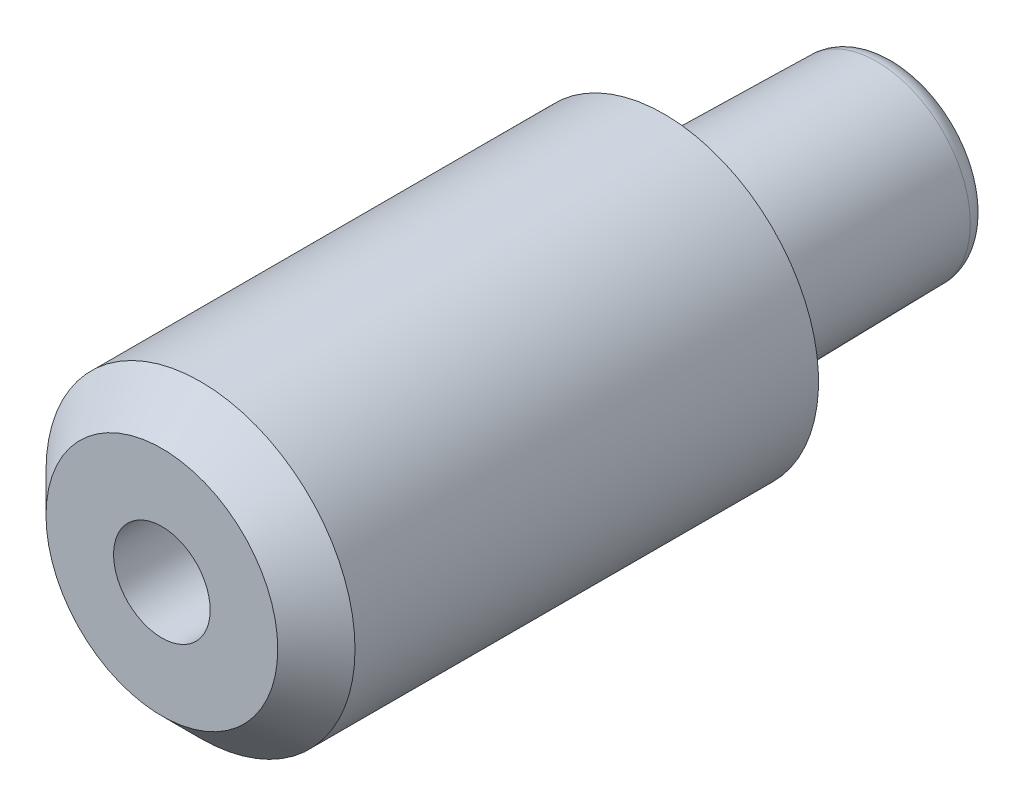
ISO-10303-21;
HEADER;
FILE_DESCRIPTION(('STEP AP214'),'2;1');
FILE_NAME('part.step','',(''),(''),'','','');
FILE_SCHEMA(('AUTOMOTIVE_DESIGN { 1 0 10303 214 1 1 1 1 }'));
ENDSEC;
DATA;
#1=APPLICATION_CONTEXT('core data for automotive mechanical design processes');
#2=APPLICATION_PROTOCOL_DEFINITION('international standard','automotive_design',2000,#1);
#3=PRODUCT_CONTEXT('',#1,'mechanical');
#4=PRODUCT('Part','Part','',(#3));
#5=PRODUCT_RELATED_PRODUCT_CATEGORY('part','',(#4));
#6=PRODUCT_DEFINITION_FORMATION('','',#4);
#7=PRODUCT_DEFINITION_CONTEXT('part definition',#1,'design');
#8=PRODUCT_DEFINITION('design','',#6,#7);
#9=PRODUCT_DEFINITION_SHAPE('','',#8);
#10=(LENGTH_UNIT() NAMED_UNIT(*) SI_UNIT(.MILLI.,.METRE.));
#11=(NAMED_UNIT(*) PLANE_ANGLE_UNIT() SI_UNIT($,.RADIAN.));
#12=(NAMED_UNIT(*) SI_UNIT($,.STERADIAN.) SOLID_ANGLE_UNIT());
#13=UNCERTAINTY_MEASURE_WITH_UNIT(LENGTH_MEASURE(1.E-05),#10,'distance_accuracy_value','');
#14=(GEOMETRIC_REPRESENTATION_CONTEXT(3) GLOBAL_UNCERTAINTY_ASSIGNED_CONTEXT((#13)) GLOBAL_UNIT_ASSIGNED_CONTEXT((#10,
#11,#12)) REPRESENTATION_CONTEXT('',''));
#15=CARTESIAN_POINT('',(0.,0.,0.));
#16=DIRECTION('',(0.,0.,1.));
#17=DIRECTION('',(1.,0.,0.));
#18=AXIS2_PLACEMENT_3D('',#15,#16,#17);
#19=CARTESIAN_POINT('',(0.,0.,11.3431457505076));
#20=DIRECTION('',(0.,0.,-1.));
#21=DIRECTION('',(1.,0.,0.));
#22=AXIS2_PLACEMENT_3D('',#19,#20,#21);
#23=CONICAL_SURFACE('',#22,5.65685424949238,0.785398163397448);
#24=CARTESIAN_POINT('',(0.,0.,14.));
#25=DIRECTION('',(0.,0.,-1.));
#26=DIRECTION('',(-1.,0.,0.));
#27=AXIS2_PLACEMENT_3D('',#24,#25,#26);
#28=CIRCLE('',#27,3.);
#29=CARTESIAN_POINT('',(-2.9999999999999,0.,14.));
#30=VERTEX_POINT('',#29);
#31=CARTESIAN_POINT('',(3.0000000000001,0.,14.));
#32=VERTEX_POINT('',#31);
#33=EDGE_CURVE('E59',#30,#32,#28,.T.);
#34=ORIENTED_EDGE('',*,*,#33,.T.);
#35=CARTESIAN_POINT('',(2.99999707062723,0.,14.0000029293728));
#36=CARTESIAN_POINT('',(3.99999755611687,0.,13.0000024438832));
#37=B_SPLINE_CURVE_WITH_KNOTS('',1,(#35,#36),.UNSPECIFIED.,.F.,.F.,(2,2),(0.530329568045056,
0.707106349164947),.UNSPECIFIED.);
#38=CARTESIAN_POINT('',(4.00000000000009,0.,13.));
#39=VERTEX_POINT('',#38);
#40=EDGE_CURVE('E46',#32,#39,#37,.T.);
#41=ORIENTED_EDGE('',*,*,#40,.T.);
#42=CARTESIAN_POINT('',(0.,0.,13.));
#43=DIRECTION('',(0.,0.,1.));
#44=DIRECTION('',(-1.,0.,0.));
#45=AXIS2_PLACEMENT_3D('',#42,#43,#44);
#46=CIRCLE('',#45,4.);
#47=CARTESIAN_POINT('',(-3.99999999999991,0.,13.));
#48=VERTEX_POINT('',#47);
#49=EDGE_CURVE('E97',#39,#48,#46,.T.);
#50=ORIENTED_EDGE('',*,*,#49,.T.);
#51=CARTESIAN_POINT('',(0.,0.,13.));
#52=DIRECTION('',(0.,0.,1.));
#53=DIRECTION('',(-1.,0.,0.));
#54=AXIS2_PLACEMENT_3D('',#51,#52,#53);
#55=CIRCLE('',#54,4.);
#56=EDGE_CURVE('E11',#48,#39,#55,.T.);
#57=ORIENTED_EDGE('',*,*,#56,.T.);
#58=ORIENTED_EDGE('',*,*,#40,.F.);
#59=CARTESIAN_POINT('',(0.,0.,14.));
#60=DIRECTION('',(0.,0.,-1.));
#61=DIRECTION('',(-1.,0.,0.));
#62=AXIS2_PLACEMENT_3D('',#59,#60,#61);
#63=CIRCLE('',#62,3.);
#64=EDGE_CURVE('E94',#32,#30,#63,.T.);
#65=ORIENTED_EDGE('',*,*,#64,.T.);
#66=EDGE_LOOP('',(#34,#41,#50,#57,#58,#65));
#67=FACE_BOUND('',#66,.T.);
#68=ADVANCED_FACE('F38',(#67),#23,.T.);
#69=CARTESIAN_POINT('',(0.,0.,7.5));
#70=DIRECTION('',(0.,0.,-1.));
#71=DIRECTION('',(-1.,0.,0.));
#72=AXIS2_PLACEMENT_3D('',#69,#70,#71);
#73=CYLINDRICAL_SURFACE('',#72,4.);
#74=ORIENTED_EDGE('',*,*,#49,.F.);
#75=ORIENTED_EDGE('',*,*,#56,.F.);
#76=CARTESIAN_POINT('',(-3.99999999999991,0.,12.9999990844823));
#77=CARTESIAN_POINT('',(-4.,0.,0.999998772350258));
#78=B_SPLINE_CURVE_WITH_KNOTS('',1,(#76,#77),.UNSPECIFIED.,.F.,.F.,(2,2),(0.0833333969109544,
0.916666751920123),.UNSPECIFIED.);
#79=CARTESIAN_POINT('',(-4.,0.,1.00000000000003));
#80=VERTEX_POINT('',#79);
#81=EDGE_CURVE('E132',#48,#80,#78,.T.);
#82=ORIENTED_EDGE('',*,*,#81,.T.);
#83=CARTESIAN_POINT('',(0.,0.,1.));
#84=DIRECTION('',(0.,0.,-1.));
#85=DIRECTION('',(-1.,0.,0.));
#86=AXIS2_PLACEMENT_3D('',#83,#84,#85);
#87=CIRCLE('',#86,4.);
#88=EDGE_CURVE('E137',#80,#80,#87,.T.);
#89=ORIENTED_EDGE('',*,*,#88,.F.);
#90=ORIENTED_EDGE('',*,*,#81,.F.);
#91=EDGE_LOOP('',(#74,#75,#82,#89,#90));
#92=FACE_BOUND('',#91,.T.);
#93=ADVANCED_FACE('F182',(#92),#73,.T.);
#94=CARTESIAN_POINT('',(-3.8999999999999,-6.23538290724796,14.));
#95=DIRECTION('',(0.,0.,1.));
#96=DIRECTION('',(1.,0.,0.));
#97=AXIS2_PLACEMENT_3D('',#94,#95,#96);
#98=PLANE('',#97);
#99=CARTESIAN_POINT('',(0.,0.,14.));
#100=DIRECTION('',(0.,0.,1.));
#101=DIRECTION('',(1.,0.,0.));
#102=AXIS2_PLACEMENT_3D('',#99,#100,#101);
#103=CIRCLE('',#102,1.24999999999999);
#104=CARTESIAN_POINT('',(1.24999999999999,0.,14.));
#105=VERTEX_POINT('',#104);
#106=EDGE_CURVE('E95',#105,#105,#103,.T.);
#107=ORIENTED_EDGE('',*,*,#106,.F.);
#108=EDGE_LOOP('',(#107));
#109=FACE_BOUND('',#108,.T.);
#110=ORIENTED_EDGE('',*,*,#64,.F.);
#111=ORIENTED_EDGE('',*,*,#33,.F.);
#112=EDGE_LOOP('',(#110,#111));
#113=FACE_BOUND('',#112,.T.);
#114=ADVANCED_FACE('F185',(#109,#113),#98,.T.);
#115=CARTESIAN_POINT('',(0.,0.,-4.5));
#116=DIRECTION('',(0.,0.,-1.));
#117=DIRECTION('',(-1.,0.,0.));
#118=AXIS2_PLACEMENT_3D('',#115,#116,#117);
#119=TOROIDAL_SURFACE('',#118,1.92137604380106,0.5);
#120=CARTESIAN_POINT('',(0.,0.,-4.50872620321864));
#121=DIRECTION('',(0.,0.,-1.));
#122=DIRECTION('',(-1.,0.,0.));
#123=AXIS2_PLACEMENT_3D('',#120,#121,#122);
#124=CIRCLE('',#123,2.42129989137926);
#125=CARTESIAN_POINT('',(-2.4212998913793,0.,-4.50872620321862));
#126=VERTEX_POINT('',#125);
#127=EDGE_CURVE('E138',#126,#126,#124,.T.);
#128=ORIENTED_EDGE('',*,*,#127,.T.);
#129=CARTESIAN_POINT('',(-2.4212998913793,0.,-4.50872620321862));
#130=CARTESIAN_POINT('',(-2.41272467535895,0.,-4.99999999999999));
#131=CARTESIAN_POINT('',(-1.9213760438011,0.,-5.));
#132=(BOUNDED_CURVE() B_SPLINE_CURVE(2,(#129,#130,#131),.UNSPECIFIED.,.F.,
.F.) B_SPLINE_CURVE_WITH_KNOTS((3,3),(0.,0.5),
.UNSPECIFIED.) CURVE() GEOMETRIC_REPRESENTATION_ITEM() RATIONAL_B_SPLINE_CURVE((1.,
0.713250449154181,1.)) REPRESENTATION_ITEM(''));
#133=CARTESIAN_POINT('',(-1.9213760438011,0.,-5.));
#134=VERTEX_POINT('',#133);
#135=EDGE_CURVE('E121',#126,#134,#132,.T.);
#136=ORIENTED_EDGE('',*,*,#135,.T.);
#137=CARTESIAN_POINT('',(0.,0.,-5.));
#138=DIRECTION('',(0.,0.,1.));
#139=DIRECTION('',(-1.,0.,0.));
#140=AXIS2_PLACEMENT_3D('',#137,#138,#139);
#141=CIRCLE('',#140,1.92137604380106);
#142=EDGE_CURVE('E127',#134,#134,#141,.T.);
#143=ORIENTED_EDGE('',*,*,#142,.T.);
#144=ORIENTED_EDGE('',*,*,#135,.F.);
#145=EDGE_LOOP('',(#128,#136,#143,#144));
#146=FACE_BOUND('',#145,.T.);
#147=ADVANCED_FACE('F187',(#146),#119,.T.);
#148=CARTESIAN_POINT('',(0.,0.,0.));
#149=DIRECTION('',(0.,0.,1.));
#150=DIRECTION('',(-1.,0.,0.));
#151=AXIS2_PLACEMENT_3D('',#148,#149,#150);
#152=CONICAL_SURFACE('',#151,2.5,0.0174532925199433);
#153=ORIENTED_EDGE('',*,*,#127,.F.);
#154=CARTESIAN_POINT('',(-2.4212998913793,0.,-4.50872620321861));
#155=CARTESIAN_POINT('',(-2.5,0.,0.));
#156=B_SPLINE_CURVE_WITH_KNOTS('',1,(#154,#155),.UNSPECIFIED.,.F.,.F.,(2,2),(0.,1.),.UNSPECIFIED.);
#157=CARTESIAN_POINT('',(-2.5,0.,0.));
#158=VERTEX_POINT('',#157);
#159=EDGE_CURVE('E110',#126,#158,#156,.T.);
#160=ORIENTED_EDGE('',*,*,#159,.T.);
#161=CARTESIAN_POINT('',(0.,0.,0.));
#162=DIRECTION('',(0.,0.,-1.));
#163=DIRECTION('',(-1.,0.,0.));
#164=AXIS2_PLACEMENT_3D('',#161,#162,#163);
#165=CIRCLE('',#164,2.5);
#166=EDGE_CURVE('E116',#158,#158,#165,.T.);
#167=ORIENTED_EDGE('',*,*,#166,.T.);
#168=ORIENTED_EDGE('',*,*,#159,.F.);
#169=EDGE_LOOP('',(#153,#160,#167,#168));
#170=FACE_BOUND('',#169,.T.);
#171=ADVANCED_FACE('F194',(#170),#152,.T.);
#172=CARTESIAN_POINT('',(4.41916490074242,-3.99350511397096,-5.));
#173=DIRECTION('',(0.,0.,-1.));
#174=DIRECTION('',(-1.,0.,0.));
#175=AXIS2_PLACEMENT_3D('',#172,#173,#174);
#176=PLANE('',#175);
#177=ORIENTED_EDGE('',*,*,#142,.F.);
#178=EDGE_LOOP('',(#177));
#179=FACE_BOUND('',#178,.T.);
#180=ADVANCED_FACE('F222',(#179),#176,.T.);
#181=CARTESIAN_POINT('',(0.,0.,0.5));
#182=DIRECTION('',(0.,0.,-1.));
#183=DIRECTION('',(-1.,0.,0.));
#184=AXIS2_PLACEMENT_3D('',#181,#182,#183);
#185=CYLINDRICAL_SURFACE('',#184,2.5);
#186=CARTESIAN_POINT('',(0.,0.,1.));
#187=DIRECTION('',(0.,0.,1.));
#188=DIRECTION('',(-1.,0.,0.));
#189=AXIS2_PLACEMENT_3D('',#186,#187,#188);
#190=CIRCLE('',#189,2.5);
#191=CARTESIAN_POINT('',(-2.5,0.,1.00000000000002));
#192=VERTEX_POINT('',#191);
#193=EDGE_CURVE('E105',#192,#192,#190,.T.);
#194=ORIENTED_EDGE('',*,*,#193,.F.);
#195=CARTESIAN_POINT('',(-2.5,0.,1.00000305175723));
#196=CARTESIAN_POINT('',(-2.5,0.,5.31746893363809E-07));
#197=B_SPLINE_CURVE_WITH_KNOTS('',1,(#195,#196),.UNSPECIFIED.,.F.,.F.,(2,2),(0.0833307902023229,
0.91666622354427),.UNSPECIFIED.);
#198=EDGE_CURVE('E102',#192,#158,#197,.T.);
#199=ORIENTED_EDGE('',*,*,#198,.T.);
#200=ORIENTED_EDGE('',*,*,#166,.F.);
#201=ORIENTED_EDGE('',*,*,#198,.F.);
#202=EDGE_LOOP('',(#194,#199,#200,#201));
#203=FACE_BOUND('',#202,.T.);
#204=ADVANCED_FACE('F231',(#203),#185,.T.);
#205=CARTESIAN_POINT('',(9.2,-8.31384387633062,0.999999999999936));
#206=DIRECTION('',(0.,0.,-1.));
#207=DIRECTION('',(-1.,0.,0.));
#208=AXIS2_PLACEMENT_3D('',#205,#206,#207);
#209=PLANE('',#208);
#210=ORIENTED_EDGE('',*,*,#88,.T.);
#211=EDGE_LOOP('',(#210));
#212=FACE_BOUND('',#211,.T.);
#213=ORIENTED_EDGE('',*,*,#193,.T.);
#214=EDGE_LOOP('',(#213));
#215=FACE_BOUND('',#214,.T.);
#216=ADVANCED_FACE('F88',(#212,#215),#209,.T.);
#217=CARTESIAN_POINT('',(0.,0.,4.49999999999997));
#218=DIRECTION('',(0.,0.,1.));
#219=DIRECTION('',(1.,0.,0.));
#220=AXIS2_PLACEMENT_3D('',#217,#218,#219);
#221=CONICAL_SURFACE('',#220,1.25,1.02974425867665);
#222=CARTESIAN_POINT('',(0.,0.,3.74892422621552));
#223=VERTEX_POINT('',#222);
#224=VERTEX_LOOP('',#223);
#225=FACE_BOUND('',#224,.T.);
#226=CARTESIAN_POINT('',(0.,0.,4.49999999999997));
#227=DIRECTION('',(0.,0.,1.));
#228=DIRECTION('',(1.,0.,0.));
#229=AXIS2_PLACEMENT_3D('',#226,#227,#228);
#230=CIRCLE('',#229,1.25);
#231=CARTESIAN_POINT('',(1.25,0.,4.49999999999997));
#232=VERTEX_POINT('',#231);
#233=EDGE_CURVE('E92',#232,#232,#230,.T.);
#234=ORIENTED_EDGE('',*,*,#233,.T.);
#235=EDGE_LOOP('',(#234));
#236=FACE_BOUND('',#235,.T.);
#237=ADVANCED_FACE('F84',(#225,#236),#221,.F.);
#238=CARTESIAN_POINT('',(0.,0.,14.));
#239=DIRECTION('',(0.,0.,1.));
#240=DIRECTION('',(1.,0.,0.));
#241=AXIS2_PLACEMENT_3D('',#238,#239,#240);
#242=CYLINDRICAL_SURFACE('',#241,1.24999999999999);
#243=ORIENTED_EDGE('',*,*,#233,.F.);
#244=EDGE_LOOP('',(#243));
#245=FACE_BOUND('',#244,.T.);
#246=ORIENTED_EDGE('',*,*,#106,.T.);
#247=EDGE_LOOP('',(#246));
#248=FACE_BOUND('',#247,.T.);
#249=ADVANCED_FACE('F87',(#245,#248),#242,.F.);
#250=CLOSED_SHELL('',(#68,#93,#114,#147,#171,#180,#204,#216,#237,#249));
#251=MANIFOLD_SOLID_BREP('B2',#250);
#252=ADVANCED_BREP_SHAPE_REPRESENTATION('',(#18,#251),#14);
#253=SHAPE_DEFINITION_REPRESENTATION(#9,#252);
ENDSEC;
END-ISO-10303-21;
